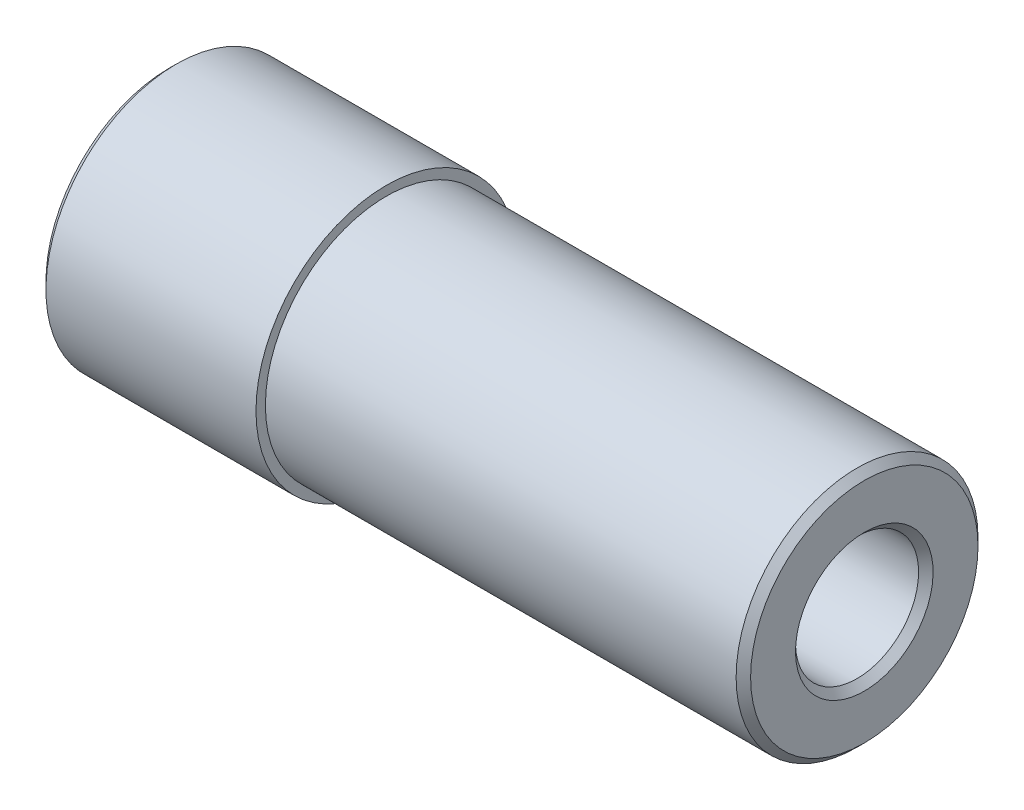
ISO-10303-21;
HEADER;
FILE_DESCRIPTION(('STEP AP214'),'2;1');
FILE_NAME('part.step','',(''),(''),'','','');
FILE_SCHEMA(('AUTOMOTIVE_DESIGN { 1 0 10303 214 1 1 1 1 }'));
ENDSEC;
DATA;
#1=APPLICATION_CONTEXT('core data for automotive mechanical design processes');
#2=APPLICATION_PROTOCOL_DEFINITION('international standard','automotive_design',2000,#1);
#3=PRODUCT_CONTEXT('',#1,'mechanical');
#4=PRODUCT('Part','Part','',(#3));
#5=PRODUCT_RELATED_PRODUCT_CATEGORY('part','',(#4));
#6=PRODUCT_DEFINITION_FORMATION('','',#4);
#7=PRODUCT_DEFINITION_CONTEXT('part definition',#1,'design');
#8=PRODUCT_DEFINITION('design','',#6,#7);
#9=PRODUCT_DEFINITION_SHAPE('','',#8);
#10=(LENGTH_UNIT() NAMED_UNIT(*) SI_UNIT(.MILLI.,.METRE.));
#11=(NAMED_UNIT(*) PLANE_ANGLE_UNIT() SI_UNIT($,.RADIAN.));
#12=(NAMED_UNIT(*) SI_UNIT($,.STERADIAN.) SOLID_ANGLE_UNIT());
#13=UNCERTAINTY_MEASURE_WITH_UNIT(LENGTH_MEASURE(1.E-05),#10,'distance_accuracy_value','');
#14=(GEOMETRIC_REPRESENTATION_CONTEXT(3) GLOBAL_UNCERTAINTY_ASSIGNED_CONTEXT((#13)) GLOBAL_UNIT_ASSIGNED_CONTEXT((#10,
#11,#12)) REPRESENTATION_CONTEXT('',''));
#15=CARTESIAN_POINT('',(0.,0.,0.));
#16=DIRECTION('',(0.,0.,1.));
#17=DIRECTION('',(1.,0.,0.));
#18=AXIS2_PLACEMENT_3D('',#15,#16,#17);
#19=CARTESIAN_POINT('',(5.797761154,0.,0.));
#20=DIRECTION('',(1.,0.,0.));
#21=DIRECTION('',(0.,0.,-1.));
#22=AXIS2_PLACEMENT_3D('',#19,#20,#21);
#23=PLANE('',#22);
#24=CARTESIAN_POINT('',(5.797761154,0.,0.));
#25=DIRECTION('',(1.,0.,0.));
#26=DIRECTION('',(0.,0.,-1.));
#27=AXIS2_PLACEMENT_3D('',#24,#25,#26);
#28=CIRCLE('',#27,5.89999999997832);
#29=CARTESIAN_POINT('',(5.797761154,0.,-5.89999999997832));
#30=VERTEX_POINT('',#29);
#31=EDGE_CURVE('E17',#30,#30,#28,.F.);
#32=ORIENTED_EDGE('',*,*,#31,.T.);
#33=EDGE_LOOP('',(#32));
#34=FACE_BOUND('',#33,.T.);
#35=ADVANCED_FACE('F14',(#34),#23,.F.);
#36=CARTESIAN_POINT('',(-3.652238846,0.,0.));
#37=DIRECTION('',(1.,0.,0.));
#38=DIRECTION('',(0.,0.,-1.));
#39=AXIS2_PLACEMENT_3D('',#36,#37,#38);
#40=CYLINDRICAL_SURFACE('',#39,5.89999999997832);
#41=ORIENTED_EDGE('',*,*,#31,.F.);
#42=EDGE_LOOP('',(#41));
#43=FACE_BOUND('',#42,.T.);
#44=CARTESIAN_POINT('',(-3.65223884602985,0.,0.));
#45=DIRECTION('',(1.,0.,0.));
#46=DIRECTION('',(0.,-0.877582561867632,-0.47942553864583));
#47=AXIS2_PLACEMENT_3D('',#44,#45,#46);
#48=CIRCLE('',#47,5.90000000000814);
#49=CARTESIAN_POINT('',(-3.65223884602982,-5.17773711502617,-2.8286106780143));
#50=VERTEX_POINT('',#49);
#51=EDGE_CURVE('E30',#50,#50,#48,.F.);
#52=ORIENTED_EDGE('',*,*,#51,.T.);
#53=EDGE_LOOP('',(#52));
#54=FACE_BOUND('',#53,.T.);
#55=ADVANCED_FACE('F58',(#43,#54),#40,.F.);
#56=CARTESIAN_POINT('',(-3.65223884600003,0.,0.));
#57=DIRECTION('',(-1.,0.,0.));
#58=DIRECTION('',(0.,0.,1.));
#59=AXIS2_PLACEMENT_3D('',#56,#57,#58);
#60=CONICAL_SURFACE('',#59,5.89999999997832,0.785398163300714);
#61=ORIENTED_EDGE('',*,*,#51,.F.);
#62=EDGE_LOOP('',(#61));
#63=FACE_BOUND('',#62,.T.);
#64=CARTESIAN_POINT('',(-4.15223884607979,0.,0.));
#65=DIRECTION('',(-1.,0.,0.));
#66=DIRECTION('',(0.,0.,1.));
#67=AXIS2_PLACEMENT_3D('',#64,#65,#66);
#68=CIRCLE('',#67,6.39999999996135);
#69=CARTESIAN_POINT('',(-4.15223884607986,0.,6.39999999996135));
#70=VERTEX_POINT('',#69);
#71=EDGE_CURVE('E47',#70,#70,#68,.T.);
#72=ORIENTED_EDGE('',*,*,#71,.T.);
#73=EDGE_LOOP('',(#72));
#74=FACE_BOUND('',#73,.T.);
#75=ADVANCED_FACE('F60',(#63,#74),#60,.F.);
#76=CARTESIAN_POINT('',(-4.152238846,0.,0.));
#77=DIRECTION('',(1.,0.,0.));
#78=DIRECTION('',(0.,0.,-1.));
#79=AXIS2_PLACEMENT_3D('',#76,#77,#78);
#80=PLANE('',#79);
#81=ORIENTED_EDGE('',*,*,#71,.F.);
#82=EDGE_LOOP('',(#81));
#83=FACE_BOUND('',#82,.T.);
#84=CARTESIAN_POINT('',(-4.15223884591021,0.,0.));
#85=DIRECTION('',(1.,0.,0.));
#86=DIRECTION('',(0.,1.,0.));
#87=AXIS2_PLACEMENT_3D('',#84,#85,#86);
#88=CIRCLE('',#87,8.4999999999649);
#89=CARTESIAN_POINT('',(-4.15223884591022,8.4999999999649,0.));
#90=VERTEX_POINT('',#89);
#91=EDGE_CURVE('E45',#90,#90,#88,.F.);
#92=ORIENTED_EDGE('',*,*,#91,.T.);
#93=EDGE_LOOP('',(#92));
#94=FACE_BOUND('',#93,.T.);
#95=ADVANCED_FACE('F66',(#83,#94),#80,.F.);
#96=CARTESIAN_POINT('',(-4.152238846,0.,0.));
#97=DIRECTION('',(1.,0.,0.));
#98=DIRECTION('',(0.,1.,0.));
#99=AXIS2_PLACEMENT_3D('',#96,#97,#98);
#100=CONICAL_SURFACE('',#99,8.49999999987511,0.785398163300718);
#101=ORIENTED_EDGE('',*,*,#91,.F.);
#102=EDGE_LOOP('',(#101));
#103=FACE_BOUND('',#102,.T.);
#104=CARTESIAN_POINT('',(-3.652238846,0.,0.));
#105=DIRECTION('',(1.,0.,0.));
#106=DIRECTION('',(0.,-0.8775825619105,-0.479425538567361));
#107=AXIS2_PLACEMENT_3D('',#104,#105,#106);
#108=CIRCLE('',#107,8.99999999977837);
#109=CARTESIAN_POINT('',(-3.652238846,-7.898243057,-4.314829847));
#110=VERTEX_POINT('',#109);
#111=EDGE_CURVE('E44',#110,#110,#108,.F.);
#112=ORIENTED_EDGE('',*,*,#111,.T.);
#113=EDGE_LOOP('',(#112));
#114=FACE_BOUND('',#113,.T.);
#115=ADVANCED_FACE('F102',(#103,#114),#100,.T.);
#116=CARTESIAN_POINT('',(-3.652238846,0.,0.));
#117=DIRECTION('',(1.,0.,0.));
#118=DIRECTION('',(0.,0.,-1.));
#119=AXIS2_PLACEMENT_3D('',#116,#117,#118);
#120=CYLINDRICAL_SURFACE('',#119,8.99999999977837);
#121=CARTESIAN_POINT('',(10.84776115,0.,0.));
#122=DIRECTION('',(1.,0.,0.));
#123=DIRECTION('',(0.,0.,-1.));
#124=AXIS2_PLACEMENT_3D('',#121,#122,#123);
#125=CIRCLE('',#124,8.99999999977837);
#126=CARTESIAN_POINT('',(10.84776115,0.,-8.99999999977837));
#127=VERTEX_POINT('',#126);
#128=EDGE_CURVE('E41',#127,#127,#125,.F.);
#129=ORIENTED_EDGE('',*,*,#128,.T.);
#130=EDGE_LOOP('',(#129));
#131=FACE_BOUND('',#130,.T.);
#132=ORIENTED_EDGE('',*,*,#111,.F.);
#133=EDGE_LOOP('',(#132));
#134=FACE_BOUND('',#133,.T.);
#135=ADVANCED_FACE('F98',(#131,#134),#120,.T.);
#136=CARTESIAN_POINT('',(10.84776115,0.,0.));
#137=DIRECTION('',(1.,0.,0.));
#138=DIRECTION('',(0.,0.,-1.));
#139=AXIS2_PLACEMENT_3D('',#136,#137,#138);
#140=PLANE('',#139);
#141=CARTESIAN_POINT('',(10.84776115,0.,0.));
#142=DIRECTION('',(1.,0.,0.));
#143=DIRECTION('',(0.,0.,-1.));
#144=AXIS2_PLACEMENT_3D('',#141,#142,#143);
#145=CIRCLE('',#144,8.35000000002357);
#146=CARTESIAN_POINT('',(10.84776115,0.,-8.35000000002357));
#147=VERTEX_POINT('',#146);
#148=EDGE_CURVE('E38',#147,#147,#145,.F.);
#149=ORIENTED_EDGE('',*,*,#148,.T.);
#150=EDGE_LOOP('',(#149));
#151=FACE_BOUND('',#150,.T.);
#152=ORIENTED_EDGE('',*,*,#128,.F.);
#153=EDGE_LOOP('',(#152));
#154=FACE_BOUND('',#153,.T.);
#155=ADVANCED_FACE('F94',(#151,#154),#140,.T.);
#156=CARTESIAN_POINT('',(10.84776115,0.,0.));
#157=DIRECTION('',(1.,0.,0.));
#158=DIRECTION('',(0.,0.,-1.));
#159=AXIS2_PLACEMENT_3D('',#156,#157,#158);
#160=CYLINDRICAL_SURFACE('',#159,8.35000000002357);
#161=ORIENTED_EDGE('',*,*,#148,.F.);
#162=EDGE_LOOP('',(#161));
#163=FACE_BOUND('',#162,.T.);
#164=CARTESIAN_POINT('',(43.3477611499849,0.,0.));
#165=DIRECTION('',(1.,0.,0.));
#166=DIRECTION('',(0.,-0.87758256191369,-0.479425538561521));
#167=AXIS2_PLACEMENT_3D('',#164,#165,#166);
#168=CIRCLE('',#167,8.35000000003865);
#169=CARTESIAN_POINT('',(43.3477611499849,-7.32781439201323,-4.00320324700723));
#170=VERTEX_POINT('',#169);
#171=EDGE_CURVE('E37',#170,#170,#168,.F.);
#172=ORIENTED_EDGE('',*,*,#171,.T.);
#173=EDGE_LOOP('',(#172));
#174=FACE_BOUND('',#173,.T.);
#175=ADVANCED_FACE('F90',(#163,#174),#160,.T.);
#176=CARTESIAN_POINT('',(43.84776115,0.,0.));
#177=DIRECTION('',(-1.,0.,0.));
#178=DIRECTION('',(0.,0.,1.));
#179=AXIS2_PLACEMENT_3D('',#176,#177,#178);
#180=CONICAL_SURFACE('',#179,7.8500000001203,0.785398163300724);
#181=ORIENTED_EDGE('',*,*,#171,.F.);
#182=EDGE_LOOP('',(#181));
#183=FACE_BOUND('',#182,.T.);
#184=CARTESIAN_POINT('',(43.8477611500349,0.,0.));
#185=DIRECTION('',(-1.,0.,0.));
#186=DIRECTION('',(0.,0.,1.));
#187=AXIS2_PLACEMENT_3D('',#184,#185,#186);
#188=CIRCLE('',#187,7.85000000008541);
#189=CARTESIAN_POINT('',(43.847761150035,0.,7.85000000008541));
#190=VERTEX_POINT('',#189);
#191=EDGE_CURVE('E34',#190,#190,#188,.F.);
#192=ORIENTED_EDGE('',*,*,#191,.F.);
#193=EDGE_LOOP('',(#192));
#194=FACE_BOUND('',#193,.T.);
#195=ADVANCED_FACE('F86',(#183,#194),#180,.T.);
#196=CARTESIAN_POINT('',(43.84776115,0.,0.));
#197=DIRECTION('',(1.,0.,0.));
#198=DIRECTION('',(0.,0.,-1.));
#199=AXIS2_PLACEMENT_3D('',#196,#197,#198);
#200=PLANE('',#199);
#201=CARTESIAN_POINT('',(43.8477611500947,0.,0.));
#202=DIRECTION('',(1.,0.,0.));
#203=DIRECTION('',(0.,1.,0.));
#204=AXIS2_PLACEMENT_3D('',#201,#202,#203);
#205=CIRCLE('',#204,4.74999999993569);
#206=CARTESIAN_POINT('',(43.8477611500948,4.74999999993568,0.));
#207=VERTEX_POINT('',#206);
#208=EDGE_CURVE('E26',#207,#207,#205,.F.);
#209=ORIENTED_EDGE('',*,*,#208,.T.);
#210=EDGE_LOOP('',(#209));
#211=FACE_BOUND('',#210,.T.);
#212=ORIENTED_EDGE('',*,*,#191,.T.);
#213=EDGE_LOOP('',(#212));
#214=FACE_BOUND('',#213,.T.);
#215=ADVANCED_FACE('F82',(#211,#214),#200,.T.);
#216=CARTESIAN_POINT('',(43.3477611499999,0.,0.));
#217=DIRECTION('',(1.,0.,0.));
#218=DIRECTION('',(0.,1.,0.));
#219=AXIS2_PLACEMENT_3D('',#216,#217,#218);
#220=CONICAL_SURFACE('',#219,4.24999999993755,0.78539816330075);
#221=ORIENTED_EDGE('',*,*,#208,.F.);
#222=EDGE_LOOP('',(#221));
#223=FACE_BOUND('',#222,.T.);
#224=CARTESIAN_POINT('',(43.34776115,0.,0.));
#225=DIRECTION('',(1.,0.,0.));
#226=DIRECTION('',(0.,0.877582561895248,0.47942553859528));
#227=AXIS2_PLACEMENT_3D('',#224,#225,#226);
#228=CIRCLE('',#227,4.24999999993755);
#229=CARTESIAN_POINT('',(43.34776115,3.729725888,2.037558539));
#230=VERTEX_POINT('',#229);
#231=EDGE_CURVE('E21',#230,#230,#228,.F.);
#232=ORIENTED_EDGE('',*,*,#231,.T.);
#233=EDGE_LOOP('',(#232));
#234=FACE_BOUND('',#233,.T.);
#235=ADVANCED_FACE('F77',(#223,#234),#220,.F.);
#236=CARTESIAN_POINT('',(18.34776115,0.,0.));
#237=DIRECTION('',(1.,0.,0.));
#238=DIRECTION('',(0.,0.,-1.));
#239=AXIS2_PLACEMENT_3D('',#236,#237,#238);
#240=CYLINDRICAL_SURFACE('',#239,4.24999999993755);
#241=CARTESIAN_POINT('',(18.34776115,0.,0.));
#242=DIRECTION('',(1.,0.,0.));
#243=DIRECTION('',(0.,0.,-1.));
#244=AXIS2_PLACEMENT_3D('',#241,#242,#243);
#245=CIRCLE('',#244,4.24999999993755);
#246=CARTESIAN_POINT('',(18.34776115,0.,-4.24999999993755));
#247=VERTEX_POINT('',#246);
#248=EDGE_CURVE('E10',#247,#247,#245,.F.);
#249=ORIENTED_EDGE('',*,*,#248,.T.);
#250=EDGE_LOOP('',(#249));
#251=FACE_BOUND('',#250,.T.);
#252=ORIENTED_EDGE('',*,*,#231,.F.);
#253=EDGE_LOOP('',(#252));
#254=FACE_BOUND('',#253,.T.);
#255=ADVANCED_FACE('F71',(#251,#254),#240,.F.);
#256=CARTESIAN_POINT('',(18.34776115,0.,0.));
#257=DIRECTION('',(1.,0.,0.));
#258=DIRECTION('',(0.,0.,-1.));
#259=AXIS2_PLACEMENT_3D('',#256,#257,#258);
#260=PLANE('',#259);
#261=ORIENTED_EDGE('',*,*,#248,.F.);
#262=EDGE_LOOP('',(#261));
#263=FACE_BOUND('',#262,.T.);
#264=ADVANCED_FACE('F69',(#263),#260,.T.);
#265=CLOSED_SHELL('',(#35,#55,#75,#95,#115,#135,#155,#175,#195,#215,#235,#255,#264));
#266=MANIFOLD_SOLID_BREP('B1',#265);
#267=ADVANCED_BREP_SHAPE_REPRESENTATION('',(#18,#266),#14);
#268=SHAPE_DEFINITION_REPRESENTATION(#9,#267);
ENDSEC;
END-ISO-10303-21;
